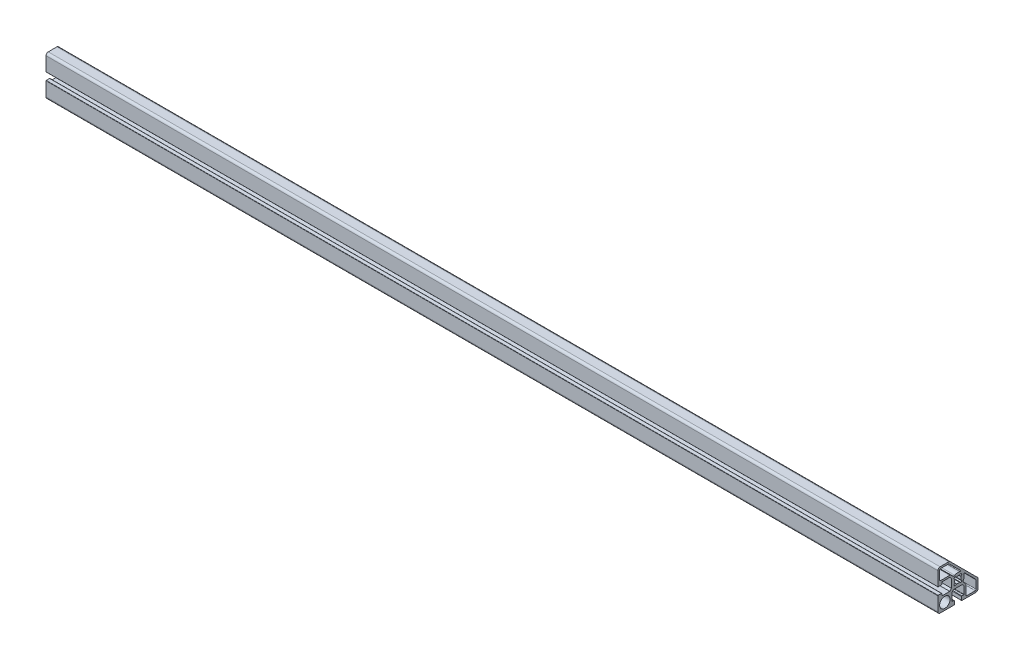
from build123d import *

# Parameters (mm, degrees)
MODEL10_R                       = 5.849991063
F_45_SARJA_1_0027_45_45_1_DEPTH = 1000


with BuildPart() as part:
    # Model10 → 45-sarja 1.0027 45 - 45_1 (new body)
    with BuildSketch(Plane(origin=(0, 0, 0), x_dir=(0, 0, -1), z_dir=(1, 0, 0))):
        with BuildLine():
            Line((-7.200998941, 4.800000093), (-7.200998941, -4.799998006))
            Line((-7.200998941, -4.799998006), (-9.200998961, -6.799999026))
            Line((-9.200998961, -6.799999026), (-17.700999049, -6.799999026))
            ThreePointArc((-17.700999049, -6.799999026), (-17.913131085, -6.71213106), (-18.000999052, -6.499999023))
            Line((-18.000999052, -6.499999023), (-18.000999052, -4.599999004))
            ThreePointArc((-18.000999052, -4.599999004), (-18.147445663, -4.246445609), (-18.500999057, -4.099998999))
            Line((-18.500999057, -4.099998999), (-22.200999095, -4.099998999))
            ThreePointArc((-22.200999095, -4.099998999), (-22.405006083, -4.180041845), (-22.500151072, -4.377458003))
            Line((-22.500151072, -4.377458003), (-22.500151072, -19.999983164))
            ThreePointArc((-22.500151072, -19.999983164), (-21.767914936, -21.767761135), (-20.000137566, -22.499998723))
            Line((-20.000137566, -22.499998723), (-4.375473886, -22.499998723))
            ThreePointArc((-4.375473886, -22.499998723), (-4.179366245, -22.404279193), (-4.099998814, -22.201002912))
            Line((-4.099998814, -22.201002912), (-4.099998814, -18.501002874))
            ThreePointArc((-4.099998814, -18.501002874), (-4.246445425, -18.14744948), (-4.599998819, -18.001002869))
            Line((-4.599998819, -18.001002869), (-6.499998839, -18.001002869))
            ThreePointArc((-6.499998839, -18.001002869), (-6.712130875, -17.913134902), (-6.799998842, -17.701002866))
            Line((-6.799998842, -17.701002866), (-6.799998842, -9.201002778))
            Line((-6.799998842, -9.201002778), (-4.799997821, -7.201002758))
            Line((-4.799997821, -7.201002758), (4.800000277, -7.201002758))
            Line((4.800000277, -7.201002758), (6.800000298, -9.201002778))
            Line((6.800000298, -9.201002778), (6.800000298, -17.701002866))
            ThreePointArc((6.800000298, -17.701002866), (6.712133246, -17.91313566), (6.500001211, -18.001004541))
            Line((6.500001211, -18.001004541), (4.600001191, -18.001004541))
            ThreePointArc((4.600001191, -18.001004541), (4.246447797, -18.147451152), (4.100001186, -18.501004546))
            Line((4.100001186, -18.501004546), (4.100001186, -22.201004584))
            ThreePointArc((4.100001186, -22.201004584), (4.179361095, -22.404272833), (4.375454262, -22.499998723))
            Line((4.375454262, -22.499998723), (19.999847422, -22.499998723))
            ThreePointArc((19.999847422, -22.499998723), (21.767615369, -21.767766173), (22.499848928, -19.999998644))
            Line((22.499848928, -19.999998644), (22.499848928, -10.355536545))
            ThreePointArc((22.499848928, -10.355536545), (22.309551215, -9.398828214), (21.767620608, -8.587770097))
            Line((21.767620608, -8.587770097), (-8.587918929, 21.76776944))
            ThreePointArc((-8.587918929, 21.76776944), (-9.398953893, 22.309700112), (-10.355641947, 22.500001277))
            Line((-10.355641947, 22.500001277), (-20.000151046, 22.500001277))
            ThreePointArc((-20.000151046, 22.500001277), (-21.767917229, 21.767776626), (-22.500151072, 20.000014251))
            Line((-22.500151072, 20.000014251), (-22.500151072, 4.377459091))
            ThreePointArc((-22.500151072, 4.377459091), (-22.40500579, 4.180043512), (-22.200999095, 4.100001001))
            Line((-22.200999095, 4.100001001), (-18.500999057, 4.100001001))
            ThreePointArc((-18.500999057, 4.100001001), (-18.147445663, 4.246447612), (-18.000999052, 4.600001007))
            Line((-18.000999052, 4.600001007), (-18.000999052, 6.500001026))
            ThreePointArc((-18.000999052, 6.500001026), (-17.913130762, 6.712132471), (-17.700999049, 6.800000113))
            Line((-17.700999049, 6.800000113), (-9.200998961, 6.800000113))
            Line((-9.200998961, 6.800000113), (-7.200998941, 4.800000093))
        make_face()
        with Locations((-14.650151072, -14.649998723)):
            Circle(MODEL10_R, mode=Mode.SUBTRACT)
        with BuildLine():
            Line((-7.785949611, 8.21420379), (-5.938044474, 6.366297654))
            ThreePointArc((-5.938044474, 6.366297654), (-4.781868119, 5.797226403), (-3.518568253, 6.051508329))
            ThreePointArc((-3.518568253, 6.051508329), (-0.595903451, 6.9746035), (2.440976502, 6.56055714))
            ThreePointArc((2.440976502, 6.56055714), (3.036076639, 6.759009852), (2.968898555, 7.382720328))
            Line((2.968898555, 7.382720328), (-9.855489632, 20.207108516))
            ThreePointArc((-9.855489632, 20.207108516), (-10.179913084, 20.423881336), (-10.562596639, 20.500001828))
            Line((-10.562596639, 20.500001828), (-19.500150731, 20.500001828))
            ThreePointArc((-19.500150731, 20.500001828), (-20.207257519, 20.207108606), (-20.500150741, 19.500001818))
            Line((-20.500150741, 19.500001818), (-20.500150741, 9.799989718))
            ThreePointArc((-20.500150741, 9.799989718), (-20.207257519, 9.09288293), (-19.500150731, 8.799989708))
            Line((-19.500150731, 8.799989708), (-9.200162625, 8.799989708))
            ThreePointArc((-9.200162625, 8.799989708), (-8.434796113, 8.647748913), (-7.785949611, 8.21420379))
        make_face(mode=Mode.SUBTRACT)
        with BuildLine():
            Line((-3.394262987, 4.38406163), (-4.384211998, 3.39411262))
            ThreePointArc((-4.384211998, 3.39411262), (-4.47207995, 3.181980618), (-4.384211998, 2.969848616))
            Line((-4.384211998, 2.969848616), (-3.363441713, 1.949078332))
            ThreePointArc((-3.363441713, 1.949078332), (-3.279726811, 1.78669155), (-3.305730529, 1.605856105))
            ThreePointArc((-3.305730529, 1.605856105), (-3.67515111, 1.038e-06), (-3.305730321, -1.605853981))
            ThreePointArc((-3.305730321, -1.605853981), (-3.279726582, -1.786689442), (-3.363441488, -1.949076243))
            Line((-3.363441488, -1.949076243), (-4.384211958, -2.969846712))
            ThreePointArc((-4.384211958, -2.969846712), (-4.47207991, -3.181978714), (-4.384211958, -3.394110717))
            Line((-4.384211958, -3.394110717), (-3.394262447, -4.384060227))
            ThreePointArc((-3.394262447, -4.384060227), (-3.182130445, -4.471928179), (-2.969998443, -4.384060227))
            Line((-2.969998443, -4.384060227), (-1.94922776, -3.363289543))
            ThreePointArc((-1.94922776, -3.363289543), (-1.786840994, -3.279574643), (-1.606005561, -3.305578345))
            ThreePointArc((-1.606005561, -3.305578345), (-0.000150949, -3.674998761), (1.605703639, -3.305578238))
            ThreePointArc((1.605703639, -3.305578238), (1.78653908, -3.279574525), (1.948925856, -3.363289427))
            Line((1.948925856, -3.363289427), (2.969697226, -4.384060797))
            ThreePointArc((2.969697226, -4.384060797), (3.181829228, -4.471928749), (3.39396123, -4.384060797))
            Line((3.39396123, -4.384060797), (4.38391118, -3.394110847))
            ThreePointArc((4.38391118, -3.394110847), (4.471779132, -3.181978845), (4.38391118, -2.969846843))
            Line((4.38391118, -2.969846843), (3.363139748, -1.949075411))
            ThreePointArc((3.363139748, -1.949075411), (3.279424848, -1.786688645), (3.30542855, -1.605853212))
            ThreePointArc((3.30542855, -1.605853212), (3.674848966, 1.4e-06), (3.305428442, 1.605855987))
            ThreePointArc((3.305428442, 1.605855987), (3.27942473, 1.786691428), (3.363139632, 1.949078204))
            Line((3.363139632, 1.949078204), (4.383909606, 2.969848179))
            ThreePointArc((4.383909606, 2.969848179), (4.471777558, 3.181980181), (4.383909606, 3.394112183))
            Line((4.383909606, 3.394112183), (3.393960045, 4.384061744))
            ThreePointArc((3.393960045, 4.384061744), (3.181828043, 4.471929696), (2.969696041, 4.384061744))
            Line((2.969696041, 4.384061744), (1.948926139, 3.363291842))
            ThreePointArc((1.948926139, 3.363291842), (1.786539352, 3.279576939), (1.605703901, 3.305580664))
            ThreePointArc((1.605703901, 3.305580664), (-0.000151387, 3.675001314), (-1.606006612, 3.305580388))
            ThreePointArc((-1.606006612, 3.305580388), (-1.786842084, 3.279576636), (-1.949228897, 3.363291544))
            Line((-1.949228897, 3.363291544), (-2.969998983, 4.38406163))
            ThreePointArc((-2.969998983, 4.38406163), (-3.182130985, 4.471929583), (-3.394262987, 4.38406163))
        make_face(mode=Mode.SUBTRACT)
        with BuildLine():
            Line((20.206956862, -9.855339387), (7.382569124, 2.969048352))
            ThreePointArc((7.382569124, 2.969048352), (6.758860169, 3.036227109), (6.560405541, 2.441129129))
            ThreePointArc((6.560405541, 2.441129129), (6.974451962, -0.595751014), (6.05135683, -3.518416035))
            ThreePointArc((6.05135683, -3.518416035), (5.797074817, -4.781715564), (6.366145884, -5.937891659))
            Line((6.366145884, -5.937891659), (8.214051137, -7.785795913))
            ThreePointArc((8.214051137, -7.785795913), (8.647596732, -8.434642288), (8.799837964, -9.200008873))
            Line((8.799837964, -9.200008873), (8.799837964, -19.499997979))
            ThreePointArc((8.799837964, -19.499997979), (9.092731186, -20.207104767), (9.799837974, -20.499997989))
            Line((9.799837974, -20.499997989), (19.499850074, -20.499997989))
            ThreePointArc((19.499850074, -20.499997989), (20.206956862, -20.207104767), (20.499850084, -19.499997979))
            Line((20.499850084, -19.499997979), (20.499850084, -10.562446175))
            ThreePointArc((20.499850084, -10.562446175), (20.423729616, -10.179762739), (20.206956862, -9.855339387))
        make_face(mode=Mode.SUBTRACT)
    extrude(amount=F_45_SARJA_1_0027_45_45_1_DEPTH)


solid = part.part
